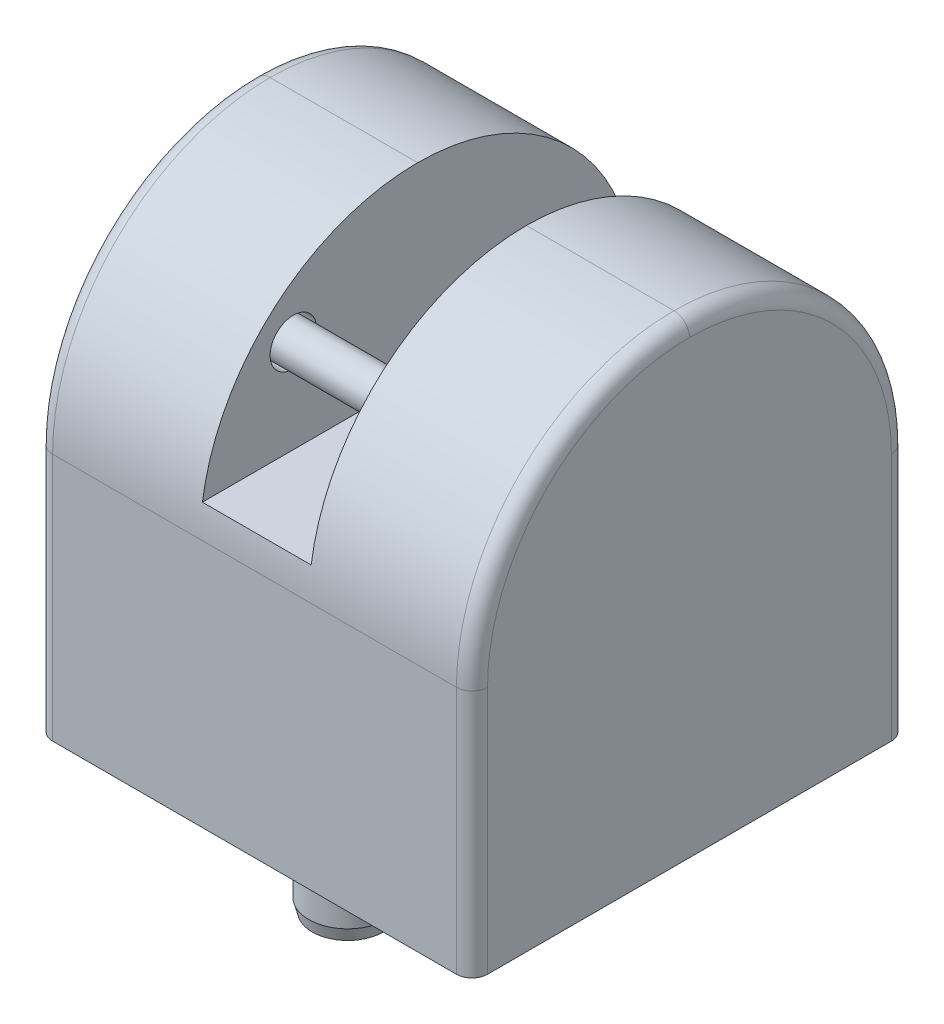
ISO-10303-21;
HEADER;
FILE_DESCRIPTION(('STEP AP214'),'2;1');
FILE_NAME('part.step','',(''),(''),'','','');
FILE_SCHEMA(('AUTOMOTIVE_DESIGN { 1 0 10303 214 1 1 1 1 }'));
ENDSEC;
DATA;
#1=APPLICATION_CONTEXT('core data for automotive mechanical design processes');
#2=APPLICATION_PROTOCOL_DEFINITION('international standard','automotive_design',2000,#1);
#3=PRODUCT_CONTEXT('',#1,'mechanical');
#4=PRODUCT('Part','Part','',(#3));
#5=PRODUCT_RELATED_PRODUCT_CATEGORY('part','',(#4));
#6=PRODUCT_DEFINITION_FORMATION('','',#4);
#7=PRODUCT_DEFINITION_CONTEXT('part definition',#1,'design');
#8=PRODUCT_DEFINITION('design','',#6,#7);
#9=PRODUCT_DEFINITION_SHAPE('','',#8);
#10=(LENGTH_UNIT() NAMED_UNIT(*) SI_UNIT(.MILLI.,.METRE.));
#11=(NAMED_UNIT(*) PLANE_ANGLE_UNIT() SI_UNIT($,.RADIAN.));
#12=(NAMED_UNIT(*) SI_UNIT($,.STERADIAN.) SOLID_ANGLE_UNIT());
#13=UNCERTAINTY_MEASURE_WITH_UNIT(LENGTH_MEASURE(1.E-05),#10,'distance_accuracy_value','');
#14=(GEOMETRIC_REPRESENTATION_CONTEXT(3) GLOBAL_UNCERTAINTY_ASSIGNED_CONTEXT((#13)) GLOBAL_UNIT_ASSIGNED_CONTEXT((#10,
#11,#12)) REPRESENTATION_CONTEXT('',''));
#15=CARTESIAN_POINT('',(0.,0.,0.));
#16=DIRECTION('',(0.,0.,1.));
#17=DIRECTION('',(1.,0.,0.));
#18=AXIS2_PLACEMENT_3D('',#15,#16,#17);
#19=CARTESIAN_POINT('',(151.285640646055,3.,-256.));
#20=DIRECTION('',(0.,1.,0.));
#21=DIRECTION('',(0.,0.,1.));
#22=AXIS2_PLACEMENT_3D('',#19,#20,#21);
#23=PLANE('',#22);
#24=CARTESIAN_POINT('',(149.,3.,-256.));
#25=DIRECTION('',(0.,-1.,0.));
#26=DIRECTION('',(0.,0.,-1.));
#27=AXIS2_PLACEMENT_3D('',#24,#25,#26);
#28=CIRCLE('',#27,2.28564064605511);
#29=CARTESIAN_POINT('',(149.,3.,-258.285640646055));
#30=VERTEX_POINT('',#29);
#31=EDGE_CURVE('E11',#30,#30,#28,.T.);
#32=ORIENTED_EDGE('',*,*,#31,.T.);
#33=EDGE_LOOP('',(#32));
#34=FACE_BOUND('',#33,.T.);
#35=ADVANCED_FACE('F43',(#34),#23,.F.);
#36=CARTESIAN_POINT('',(149.,3.8,-256.));
#37=DIRECTION('',(0.,1.,0.));
#38=DIRECTION('',(0.,0.,1.));
#39=AXIS2_PLACEMENT_3D('',#36,#37,#38);
#40=CONICAL_SURFACE('',#39,2.5,0.261799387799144);
#41=ORIENTED_EDGE('',*,*,#31,.F.);
#42=EDGE_LOOP('',(#41));
#43=FACE_BOUND('',#42,.T.);
#44=CARTESIAN_POINT('',(149.,3.8,-256.));
#45=DIRECTION('',(0.,-1.,0.));
#46=DIRECTION('',(0.,0.,-1.));
#47=AXIS2_PLACEMENT_3D('',#44,#45,#46);
#48=CIRCLE('',#47,2.5);
#49=CARTESIAN_POINT('',(149.,3.8,-258.5));
#50=VERTEX_POINT('',#49);
#51=EDGE_CURVE('E49',#50,#50,#48,.T.);
#52=ORIENTED_EDGE('',*,*,#51,.T.);
#53=EDGE_LOOP('',(#52));
#54=FACE_BOUND('',#53,.T.);
#55=ADVANCED_FACE('F75',(#43,#54),#40,.T.);
#56=CARTESIAN_POINT('',(149.,-3.34999999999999,-256.));
#57=DIRECTION('',(0.,-1.,0.));
#58=DIRECTION('',(0.,0.,-1.));
#59=AXIS2_PLACEMENT_3D('',#56,#57,#58);
#60=CYLINDRICAL_SURFACE('',#59,2.5);
#61=ORIENTED_EDGE('',*,*,#51,.F.);
#62=EDGE_LOOP('',(#61));
#63=FACE_BOUND('',#62,.T.);
#64=CARTESIAN_POINT('',(149.,18.2,-256.));
#65=DIRECTION('',(0.,-1.,0.));
#66=DIRECTION('',(0.,0.,-1.));
#67=AXIS2_PLACEMENT_3D('',#64,#65,#66);
#68=CIRCLE('',#67,2.5);
#69=CARTESIAN_POINT('',(149.,18.2,-258.5));
#70=VERTEX_POINT('',#69);
#71=EDGE_CURVE('E53',#70,#70,#68,.T.);
#72=ORIENTED_EDGE('',*,*,#71,.T.);
#73=EDGE_LOOP('',(#72));
#74=FACE_BOUND('',#73,.T.);
#75=ADVANCED_FACE('F71',(#63,#74),#60,.T.);
#76=CARTESIAN_POINT('',(149.,19.,-256.));
#77=DIRECTION('',(0.,-1.,0.));
#78=DIRECTION('',(0.,0.,-1.));
#79=AXIS2_PLACEMENT_3D('',#76,#77,#78);
#80=CONICAL_SURFACE('',#79,2.2856406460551,0.26179938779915);
#81=ORIENTED_EDGE('',*,*,#71,.F.);
#82=EDGE_LOOP('',(#81));
#83=FACE_BOUND('',#82,.T.);
#84=CARTESIAN_POINT('',(149.,19.,-256.));
#85=DIRECTION('',(0.,-1.,0.));
#86=DIRECTION('',(0.,0.,-1.));
#87=AXIS2_PLACEMENT_3D('',#84,#85,#86);
#88=CIRCLE('',#87,2.2856406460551);
#89=CARTESIAN_POINT('',(149.,19.,-258.285640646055));
#90=VERTEX_POINT('',#89);
#91=EDGE_CURVE('E57',#90,#90,#88,.T.);
#92=ORIENTED_EDGE('',*,*,#91,.T.);
#93=EDGE_LOOP('',(#92));
#94=FACE_BOUND('',#93,.T.);
#95=ADVANCED_FACE('F63',(#83,#94),#80,.T.);
#96=CARTESIAN_POINT('',(149.,19.,-256.));
#97=DIRECTION('',(0.,-1.,0.));
#98=DIRECTION('',(0.,0.,-1.));
#99=AXIS2_PLACEMENT_3D('',#96,#97,#98);
#100=PLANE('',#99);
#101=ORIENTED_EDGE('',*,*,#91,.F.);
#102=EDGE_LOOP('',(#101));
#103=FACE_BOUND('',#102,.T.);
#104=ADVANCED_FACE('F65',(#103),#100,.F.);
#105=CLOSED_SHELL('',(#35,#55,#75,#95,#104));
#106=MANIFOLD_SOLID_BREP('B2',#105);
#107=CARTESIAN_POINT('',(151.285640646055,3.,-240.));
#108=DIRECTION('',(0.,1.,0.));
#109=DIRECTION('',(0.,0.,1.));
#110=AXIS2_PLACEMENT_3D('',#107,#108,#109);
#111=PLANE('',#110);
#112=CARTESIAN_POINT('',(149.,3.,-240.));
#113=DIRECTION('',(0.,-1.,0.));
#114=DIRECTION('',(0.,0.,-1.));
#115=AXIS2_PLACEMENT_3D('',#112,#113,#114);
#116=CIRCLE('',#115,2.28564064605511);
#117=CARTESIAN_POINT('',(149.,3.,-242.285640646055));
#118=VERTEX_POINT('',#117);
#119=EDGE_CURVE('E42',#118,#118,#116,.T.);
#120=ORIENTED_EDGE('',*,*,#119,.T.);
#121=EDGE_LOOP('',(#120));
#122=FACE_BOUND('',#121,.T.);
#123=ADVANCED_FACE('F123',(#122),#111,.F.);
#124=CARTESIAN_POINT('',(149.,3.80000000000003,-240.));
#125=DIRECTION('',(0.,1.,0.));
#126=DIRECTION('',(0.,0.,1.));
#127=AXIS2_PLACEMENT_3D('',#124,#125,#126);
#128=CONICAL_SURFACE('',#127,2.5,0.261799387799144);
#129=ORIENTED_EDGE('',*,*,#119,.F.);
#130=EDGE_LOOP('',(#129));
#131=FACE_BOUND('',#130,.T.);
#132=CARTESIAN_POINT('',(149.,3.80000000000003,-240.));
#133=DIRECTION('',(0.,-1.,0.));
#134=DIRECTION('',(0.,0.,-1.));
#135=AXIS2_PLACEMENT_3D('',#132,#133,#134);
#136=CIRCLE('',#135,2.5);
#137=CARTESIAN_POINT('',(149.,3.80000000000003,-242.5));
#138=VERTEX_POINT('',#137);
#139=EDGE_CURVE('E129',#138,#138,#136,.T.);
#140=ORIENTED_EDGE('',*,*,#139,.T.);
#141=EDGE_LOOP('',(#140));
#142=FACE_BOUND('',#141,.T.);
#143=ADVANCED_FACE('F155',(#131,#142),#128,.T.);
#144=CARTESIAN_POINT('',(149.,-3.35000000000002,-240.));
#145=DIRECTION('',(0.,-1.,0.));
#146=DIRECTION('',(0.,0.,-1.));
#147=AXIS2_PLACEMENT_3D('',#144,#145,#146);
#148=CYLINDRICAL_SURFACE('',#147,2.5);
#149=ORIENTED_EDGE('',*,*,#139,.F.);
#150=EDGE_LOOP('',(#149));
#151=FACE_BOUND('',#150,.T.);
#152=CARTESIAN_POINT('',(149.,18.2,-240.));
#153=DIRECTION('',(0.,-1.,0.));
#154=DIRECTION('',(0.,0.,-1.));
#155=AXIS2_PLACEMENT_3D('',#152,#153,#154);
#156=CIRCLE('',#155,2.5);
#157=CARTESIAN_POINT('',(149.,18.2,-242.5));
#158=VERTEX_POINT('',#157);
#159=EDGE_CURVE('E133',#158,#158,#156,.T.);
#160=ORIENTED_EDGE('',*,*,#159,.T.);
#161=EDGE_LOOP('',(#160));
#162=FACE_BOUND('',#161,.T.);
#163=ADVANCED_FACE('F151',(#151,#162),#148,.T.);
#164=CARTESIAN_POINT('',(149.,19.,-240.));
#165=DIRECTION('',(0.,-1.,0.));
#166=DIRECTION('',(0.,0.,-1.));
#167=AXIS2_PLACEMENT_3D('',#164,#165,#166);
#168=CONICAL_SURFACE('',#167,2.2856406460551,0.26179938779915);
#169=ORIENTED_EDGE('',*,*,#159,.F.);
#170=EDGE_LOOP('',(#169));
#171=FACE_BOUND('',#170,.T.);
#172=CARTESIAN_POINT('',(149.,19.,-240.));
#173=DIRECTION('',(0.,-1.,0.));
#174=DIRECTION('',(0.,0.,-1.));
#175=AXIS2_PLACEMENT_3D('',#172,#173,#174);
#176=CIRCLE('',#175,2.2856406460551);
#177=CARTESIAN_POINT('',(149.,19.,-242.285640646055));
#178=VERTEX_POINT('',#177);
#179=EDGE_CURVE('E137',#178,#178,#176,.T.);
#180=ORIENTED_EDGE('',*,*,#179,.T.);
#181=EDGE_LOOP('',(#180));
#182=FACE_BOUND('',#181,.T.);
#183=ADVANCED_FACE('F143',(#171,#182),#168,.T.);
#184=CARTESIAN_POINT('',(149.,19.,-240.));
#185=DIRECTION('',(0.,-1.,0.));
#186=DIRECTION('',(0.,0.,-1.));
#187=AXIS2_PLACEMENT_3D('',#184,#185,#186);
#188=PLANE('',#187);
#189=ORIENTED_EDGE('',*,*,#179,.F.);
#190=EDGE_LOOP('',(#189));
#191=FACE_BOUND('',#190,.T.);
#192=ADVANCED_FACE('F145',(#191),#188,.F.);
#193=CLOSED_SHELL('',(#123,#143,#163,#183,#192));
#194=MANIFOLD_SOLID_BREP('B6',#193);
#195=CARTESIAN_POINT('',(163.,39.,-234.));
#196=DIRECTION('',(-1.,0.,0.));
#197=DIRECTION('',(0.,0.,1.));
#198=AXIS2_PLACEMENT_3D('',#195,#196,#197);
#199=PLANE('',#198);
#200=DIRECTION('',(0.,0.,-1.));
#201=VECTOR('',#200,1.);
#202=CARTESIAN_POINT('',(163.,9.,-234.));
#203=LINE('',#202,#201);
#204=CARTESIAN_POINT('',(163.,9.,-235.));
#205=VERTEX_POINT('',#204);
#206=CARTESIAN_POINT('',(163.,9.,-261.));
#207=VERTEX_POINT('',#206);
#208=EDGE_CURVE('E324',#205,#207,#203,.T.);
#209=ORIENTED_EDGE('',*,*,#208,.T.);
#210=DIRECTION('',(0.,-1.,0.));
#211=VECTOR('',#210,1.);
#212=CARTESIAN_POINT('',(163.,39.,-261.));
#213=LINE('',#212,#211);
#214=CARTESIAN_POINT('',(163.,25.,-261.));
#215=VERTEX_POINT('',#214);
#216=EDGE_CURVE('E217',#207,#215,#213,.F.);
#217=ORIENTED_EDGE('',*,*,#216,.T.);
#218=CARTESIAN_POINT('',(163.,25.,-248.));
#219=DIRECTION('',(-1.,0.,0.));
#220=DIRECTION('',(0.,0.,1.));
#221=AXIS2_PLACEMENT_3D('',#218,#219,#220);
#222=CIRCLE('',#221,13.);
#223=CARTESIAN_POINT('',(163.,38.,-248.));
#224=VERTEX_POINT('',#223);
#225=EDGE_CURVE('E392',#215,#224,#222,.F.);
#226=ORIENTED_EDGE('',*,*,#225,.T.);
#227=CARTESIAN_POINT('',(163.,25.,-248.));
#228=DIRECTION('',(-1.,0.,0.));
#229=DIRECTION('',(0.,0.,1.));
#230=AXIS2_PLACEMENT_3D('',#227,#228,#229);
#231=CIRCLE('',#230,13.);
#232=CARTESIAN_POINT('',(163.,25.,-235.));
#233=VERTEX_POINT('',#232);
#234=EDGE_CURVE('E223',#224,#233,#231,.F.);
#235=ORIENTED_EDGE('',*,*,#234,.T.);
#236=DIRECTION('',(0.,-1.,0.));
#237=VECTOR('',#236,1.);
#238=CARTESIAN_POINT('',(163.,39.,-235.));
#239=LINE('',#238,#237);
#240=EDGE_CURVE('E390',#233,#205,#239,.T.);
#241=ORIENTED_EDGE('',*,*,#240,.T.);
#242=EDGE_LOOP('',(#209,#217,#226,#235,#241));
#243=FACE_BOUND('',#242,.T.);
#244=ADVANCED_FACE('F200',(#243),#199,.F.);
#245=CARTESIAN_POINT('',(163.,39.,-262.));
#246=DIRECTION('',(0.,0.,1.));
#247=DIRECTION('',(1.,0.,0.));
#248=AXIS2_PLACEMENT_3D('',#245,#246,#247);
#249=PLANE('',#248);
#250=DIRECTION('',(-1.,0.,0.));
#251=VECTOR('',#250,1.);
#252=CARTESIAN_POINT('',(163.,9.,-262.));
#253=LINE('',#252,#251);
#254=CARTESIAN_POINT('',(162.,9.,-262.));
#255=VERTEX_POINT('',#254);
#256=CARTESIAN_POINT('',(136.,9.,-262.));
#257=VERTEX_POINT('',#256);
#258=EDGE_CURVE('E332',#255,#257,#253,.T.);
#259=ORIENTED_EDGE('',*,*,#258,.T.);
#260=DIRECTION('',(0.,-1.,0.));
#261=VECTOR('',#260,1.);
#262=CARTESIAN_POINT('',(136.,39.,-262.));
#263=LINE('',#262,#261);
#264=CARTESIAN_POINT('',(136.,25.,-262.));
#265=VERTEX_POINT('',#264);
#266=EDGE_CURVE('E383',#257,#265,#263,.F.);
#267=ORIENTED_EDGE('',*,*,#266,.T.);
#268=DIRECTION('',(-1.,0.,0.));
#269=VECTOR('',#268,1.);
#270=CARTESIAN_POINT('',(145.5,25.,-262.));
#271=LINE('',#270,#269);
#272=CARTESIAN_POINT('',(162.,25.,-262.));
#273=VERTEX_POINT('',#272);
#274=EDGE_CURVE('E318',#265,#273,#271,.F.);
#275=ORIENTED_EDGE('',*,*,#274,.T.);
#276=DIRECTION('',(0.,-1.,0.));
#277=VECTOR('',#276,1.);
#278=CARTESIAN_POINT('',(162.,39.,-262.));
#279=LINE('',#278,#277);
#280=EDGE_CURVE('E380',#273,#255,#279,.T.);
#281=ORIENTED_EDGE('',*,*,#280,.T.);
#282=EDGE_LOOP('',(#259,#267,#275,#281));
#283=FACE_BOUND('',#282,.T.);
#284=ADVANCED_FACE('F446',(#283),#249,.F.);
#285=CARTESIAN_POINT('',(135.,39.,-234.));
#286=DIRECTION('',(1.,0.,0.));
#287=DIRECTION('',(0.,0.,-1.));
#288=AXIS2_PLACEMENT_3D('',#285,#286,#287);
#289=PLANE('',#288);
#290=DIRECTION('',(0.,0.,1.));
#291=VECTOR('',#290,1.);
#292=CARTESIAN_POINT('',(135.,9.,-234.));
#293=LINE('',#292,#291);
#294=CARTESIAN_POINT('',(135.,9.,-261.));
#295=VERTEX_POINT('',#294);
#296=CARTESIAN_POINT('',(135.,9.,-235.));
#297=VERTEX_POINT('',#296);
#298=EDGE_CURVE('E335',#295,#297,#293,.T.);
#299=ORIENTED_EDGE('',*,*,#298,.T.);
#300=DIRECTION('',(0.,-1.,0.));
#301=VECTOR('',#300,1.);
#302=CARTESIAN_POINT('',(135.,39.,-235.));
#303=LINE('',#302,#301);
#304=CARTESIAN_POINT('',(135.,25.,-235.));
#305=VERTEX_POINT('',#304);
#306=EDGE_CURVE('E378',#297,#305,#303,.F.);
#307=ORIENTED_EDGE('',*,*,#306,.T.);
#308=CARTESIAN_POINT('',(135.,25.,-248.));
#309=DIRECTION('',(1.,0.,0.));
#310=DIRECTION('',(0.,0.,-1.));
#311=AXIS2_PLACEMENT_3D('',#308,#309,#310);
#312=CIRCLE('',#311,13.);
#313=CARTESIAN_POINT('',(135.,38.,-248.));
#314=VERTEX_POINT('',#313);
#315=EDGE_CURVE('E372',#305,#314,#312,.F.);
#316=ORIENTED_EDGE('',*,*,#315,.T.);
#317=CARTESIAN_POINT('',(135.,25.,-248.));
#318=DIRECTION('',(1.,0.,0.));
#319=DIRECTION('',(0.,0.,-1.));
#320=AXIS2_PLACEMENT_3D('',#317,#318,#319);
#321=CIRCLE('',#320,13.);
#322=CARTESIAN_POINT('',(135.,25.,-261.));
#323=VERTEX_POINT('',#322);
#324=EDGE_CURVE('E374',#314,#323,#321,.F.);
#325=ORIENTED_EDGE('',*,*,#324,.T.);
#326=DIRECTION('',(0.,-1.,0.));
#327=VECTOR('',#326,1.);
#328=CARTESIAN_POINT('',(135.,39.,-261.));
#329=LINE('',#328,#327);
#330=EDGE_CURVE('E376',#323,#295,#329,.T.);
#331=ORIENTED_EDGE('',*,*,#330,.T.);
#332=EDGE_LOOP('',(#299,#307,#316,#325,#331));
#333=FACE_BOUND('',#332,.T.);
#334=ADVANCED_FACE('F451',(#333),#289,.F.);
#335=CARTESIAN_POINT('',(163.,39.,-234.));
#336=DIRECTION('',(0.,0.,-1.));
#337=DIRECTION('',(-1.,0.,0.));
#338=AXIS2_PLACEMENT_3D('',#335,#336,#337);
#339=PLANE('',#338);
#340=DIRECTION('',(1.,0.,0.));
#341=VECTOR('',#340,1.);
#342=CARTESIAN_POINT('',(135.,25.,-234.));
#343=LINE('',#342,#341);
#344=CARTESIAN_POINT('',(162.,25.,-234.));
#345=VERTEX_POINT('',#344);
#346=CARTESIAN_POINT('',(136.,25.,-234.));
#347=VERTEX_POINT('',#346);
#348=EDGE_CURVE('E307',#345,#347,#343,.F.);
#349=ORIENTED_EDGE('',*,*,#348,.T.);
#350=DIRECTION('',(0.,-1.,0.));
#351=VECTOR('',#350,1.);
#352=CARTESIAN_POINT('',(136.,39.,-234.));
#353=LINE('',#352,#351);
#354=CARTESIAN_POINT('',(136.,9.,-234.));
#355=VERTEX_POINT('',#354);
#356=EDGE_CURVE('E361',#347,#355,#353,.T.);
#357=ORIENTED_EDGE('',*,*,#356,.T.);
#358=DIRECTION('',(1.,0.,0.));
#359=VECTOR('',#358,1.);
#360=CARTESIAN_POINT('',(163.,9.,-234.));
#361=LINE('',#360,#359);
#362=CARTESIAN_POINT('',(162.,9.,-234.));
#363=VERTEX_POINT('',#362);
#364=EDGE_CURVE('E338',#355,#363,#361,.T.);
#365=ORIENTED_EDGE('',*,*,#364,.T.);
#366=DIRECTION('',(0.,-1.,0.));
#367=VECTOR('',#366,1.);
#368=CARTESIAN_POINT('',(162.,39.,-234.));
#369=LINE('',#368,#367);
#370=EDGE_CURVE('E354',#363,#345,#369,.F.);
#371=ORIENTED_EDGE('',*,*,#370,.T.);
#372=EDGE_LOOP('',(#349,#357,#365,#371));
#373=FACE_BOUND('',#372,.T.);
#374=ADVANCED_FACE('F523',(#373),#339,.F.);
#375=CARTESIAN_POINT('',(297.999999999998,9.,-492.000000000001));
#376=DIRECTION('',(0.,1.,0.));
#377=DIRECTION('',(0.,0.,-1.));
#378=AXIS2_PLACEMENT_3D('',#375,#376,#377);
#379=PLANE('',#378);
#380=CARTESIAN_POINT('',(149.,9.,-240.));
#381=DIRECTION('',(0.,1.,0.));
#382=DIRECTION('',(0.,0.,-1.));
#383=AXIS2_PLACEMENT_3D('',#380,#381,#382);
#384=CIRCLE('',#383,2.99999999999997);
#385=CARTESIAN_POINT('',(149.,9.,-243.));
#386=VERTEX_POINT('',#385);
#387=EDGE_CURVE('E204',#386,#386,#384,.F.);
#388=ORIENTED_EDGE('',*,*,#387,.F.);
#389=EDGE_LOOP('',(#388));
#390=FACE_BOUND('',#389,.T.);
#391=CARTESIAN_POINT('',(149.,9.,-256.));
#392=DIRECTION('',(0.,1.,0.));
#393=DIRECTION('',(0.,0.,-1.));
#394=AXIS2_PLACEMENT_3D('',#391,#392,#393);
#395=CIRCLE('',#394,2.99999999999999);
#396=CARTESIAN_POINT('',(149.,9.,-259.));
#397=VERTEX_POINT('',#396);
#398=EDGE_CURVE('E412',#397,#397,#395,.F.);
#399=ORIENTED_EDGE('',*,*,#398,.F.);
#400=EDGE_LOOP('',(#399));
#401=FACE_BOUND('',#400,.T.);
#402=ORIENTED_EDGE('',*,*,#364,.F.);
#403=CARTESIAN_POINT('',(136.,9.,-235.));
#404=DIRECTION('',(0.,1.,0.));
#405=DIRECTION('',(0.,0.,-1.));
#406=AXIS2_PLACEMENT_3D('',#403,#404,#405);
#407=CIRCLE('',#406,1.);
#408=EDGE_CURVE('E370',#355,#297,#407,.F.);
#409=ORIENTED_EDGE('',*,*,#408,.T.);
#410=ORIENTED_EDGE('',*,*,#298,.F.);
#411=CARTESIAN_POINT('',(136.,9.,-261.));
#412=DIRECTION('',(0.,1.,0.));
#413=DIRECTION('',(0.,0.,-1.));
#414=AXIS2_PLACEMENT_3D('',#411,#412,#413);
#415=CIRCLE('',#414,1.);
#416=EDGE_CURVE('E368',#295,#257,#415,.F.);
#417=ORIENTED_EDGE('',*,*,#416,.T.);
#418=ORIENTED_EDGE('',*,*,#258,.F.);
#419=CARTESIAN_POINT('',(162.,9.,-261.));
#420=DIRECTION('',(0.,1.,0.));
#421=DIRECTION('',(0.,0.,-1.));
#422=AXIS2_PLACEMENT_3D('',#419,#420,#421);
#423=CIRCLE('',#422,1.);
#424=EDGE_CURVE('E366',#255,#207,#423,.F.);
#425=ORIENTED_EDGE('',*,*,#424,.T.);
#426=ORIENTED_EDGE('',*,*,#208,.F.);
#427=CARTESIAN_POINT('',(162.,9.,-235.));
#428=DIRECTION('',(0.,1.,0.));
#429=DIRECTION('',(0.,0.,-1.));
#430=AXIS2_PLACEMENT_3D('',#427,#428,#429);
#431=CIRCLE('',#430,1.);
#432=EDGE_CURVE('E364',#205,#363,#431,.F.);
#433=ORIENTED_EDGE('',*,*,#432,.T.);
#434=EDGE_LOOP('',(#402,#409,#410,#417,#418,#425,#426,#433));
#435=FACE_BOUND('',#434,.T.);
#436=ADVANCED_FACE('F502',(#390,#401,#435),#379,.F.);
#437=CARTESIAN_POINT('',(152.5,27.,-234.));
#438=DIRECTION('',(1.,0.,0.));
#439=DIRECTION('',(0.,0.,-1.));
#440=AXIS2_PLACEMENT_3D('',#437,#438,#439);
#441=PLANE('',#440);
#442=CARTESIAN_POINT('',(152.5,33.,-240.));
#443=DIRECTION('',(1.,0.,0.));
#444=DIRECTION('',(0.,0.,-1.));
#445=AXIS2_PLACEMENT_3D('',#442,#443,#444);
#446=CIRCLE('',#445,1.49999999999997);
#447=CARTESIAN_POINT('',(152.5,33.,-241.5));
#448=VERTEX_POINT('',#447);
#449=EDGE_CURVE('E322',#448,#448,#446,.F.);
#450=ORIENTED_EDGE('',*,*,#449,.F.);
#451=EDGE_LOOP('',(#450));
#452=FACE_BOUND('',#451,.T.);
#453=DIRECTION('',(0.,0.,-1.));
#454=VECTOR('',#453,1.);
#455=CARTESIAN_POINT('',(152.5,27.,-234.));
#456=LINE('',#455,#454);
#457=CARTESIAN_POINT('',(152.5,27.,-234.143593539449));
#458=VERTEX_POINT('',#457);
#459=CARTESIAN_POINT('',(152.5,27.,-261.856406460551));
#460=VERTEX_POINT('',#459);
#461=EDGE_CURVE('E301',#458,#460,#456,.T.);
#462=ORIENTED_EDGE('',*,*,#461,.F.);
#463=CARTESIAN_POINT('',(152.5,25.,-248.));
#464=DIRECTION('',(1.,0.,0.));
#465=DIRECTION('',(0.,0.,-1.));
#466=AXIS2_PLACEMENT_3D('',#463,#464,#465);
#467=CIRCLE('',#466,14.);
#468=CARTESIAN_POINT('',(152.5,39.,-248.));
#469=VERTEX_POINT('',#468);
#470=EDGE_CURVE('E310',#458,#469,#467,.F.);
#471=ORIENTED_EDGE('',*,*,#470,.T.);
#472=CARTESIAN_POINT('',(152.5,25.,-248.));
#473=DIRECTION('',(1.,0.,0.));
#474=DIRECTION('',(0.,0.,-1.));
#475=AXIS2_PLACEMENT_3D('',#472,#473,#474);
#476=CIRCLE('',#475,14.);
#477=EDGE_CURVE('E319',#469,#460,#476,.F.);
#478=ORIENTED_EDGE('',*,*,#477,.T.);
#479=EDGE_LOOP('',(#462,#471,#478));
#480=FACE_BOUND('',#479,.T.);
#481=ADVANCED_FACE('F321',(#452,#480),#441,.F.);
#482=CARTESIAN_POINT('',(145.5,27.,-234.));
#483=DIRECTION('',(1.,0.,0.));
#484=DIRECTION('',(0.,0.,-1.));
#485=AXIS2_PLACEMENT_3D('',#482,#483,#484);
#486=PLANE('',#485);
#487=CARTESIAN_POINT('',(145.5,33.,-240.));
#488=DIRECTION('',(1.,0.,0.));
#489=DIRECTION('',(0.,0.,-1.));
#490=AXIS2_PLACEMENT_3D('',#487,#488,#489);
#491=CIRCLE('',#490,1.49999999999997);
#492=CARTESIAN_POINT('',(145.5,33.,-241.5));
#493=VERTEX_POINT('',#492);
#494=EDGE_CURVE('E327',#493,#493,#491,.F.);
#495=ORIENTED_EDGE('',*,*,#494,.T.);
#496=EDGE_LOOP('',(#495));
#497=FACE_BOUND('',#496,.T.);
#498=DIRECTION('',(0.,0.,-1.));
#499=VECTOR('',#498,1.);
#500=CARTESIAN_POINT('',(145.5,27.,-234.));
#501=LINE('',#500,#499);
#502=CARTESIAN_POINT('',(145.5,27.,-234.143593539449));
#503=VERTEX_POINT('',#502);
#504=CARTESIAN_POINT('',(145.5,27.,-261.856406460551));
#505=VERTEX_POINT('',#504);
#506=EDGE_CURVE('E303',#503,#505,#501,.T.);
#507=ORIENTED_EDGE('',*,*,#506,.T.);
#508=CARTESIAN_POINT('',(145.5,25.,-248.));
#509=DIRECTION('',(1.,0.,0.));
#510=DIRECTION('',(0.,0.,-1.));
#511=AXIS2_PLACEMENT_3D('',#508,#509,#510);
#512=CIRCLE('',#511,14.);
#513=CARTESIAN_POINT('',(145.5,39.,-248.));
#514=VERTEX_POINT('',#513);
#515=EDGE_CURVE('E352',#505,#514,#512,.T.);
#516=ORIENTED_EDGE('',*,*,#515,.T.);
#517=CARTESIAN_POINT('',(145.5,25.,-248.));
#518=DIRECTION('',(1.,0.,0.));
#519=DIRECTION('',(0.,0.,-1.));
#520=AXIS2_PLACEMENT_3D('',#517,#518,#519);
#521=CIRCLE('',#520,14.);
#522=EDGE_CURVE('E350',#514,#503,#521,.T.);
#523=ORIENTED_EDGE('',*,*,#522,.T.);
#524=EDGE_LOOP('',(#507,#516,#523));
#525=FACE_BOUND('',#524,.T.);
#526=ADVANCED_FACE('F442',(#497,#525),#486,.T.);
#527=CARTESIAN_POINT('',(297.999999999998,27.,-492.000000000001));
#528=DIRECTION('',(0.,-1.,0.));
#529=DIRECTION('',(1.,0.,0.));
#530=AXIS2_PLACEMENT_3D('',#527,#528,#529);
#531=PLANE('',#530);
#532=ORIENTED_EDGE('',*,*,#461,.T.);
#533=DIRECTION('',(1.,0.,0.));
#534=VECTOR('',#533,1.);
#535=CARTESIAN_POINT('',(152.5,27.,-261.856406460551));
#536=LINE('',#535,#534);
#537=EDGE_CURVE('E306',#460,#505,#536,.F.);
#538=ORIENTED_EDGE('',*,*,#537,.T.);
#539=ORIENTED_EDGE('',*,*,#506,.F.);
#540=DIRECTION('',(-1.,0.,0.));
#541=VECTOR('',#540,1.);
#542=CARTESIAN_POINT('',(145.5,27.,-234.143593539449));
#543=LINE('',#542,#541);
#544=EDGE_CURVE('E297',#503,#458,#543,.F.);
#545=ORIENTED_EDGE('',*,*,#544,.T.);
#546=EDGE_LOOP('',(#532,#538,#539,#545));
#547=FACE_BOUND('',#546,.T.);
#548=ADVANCED_FACE('F299',(#547),#531,.F.);
#549=CARTESIAN_POINT('',(139.5,33.,-240.));
#550=DIRECTION('',(-1.,0.,0.));
#551=DIRECTION('',(0.,0.,1.));
#552=AXIS2_PLACEMENT_3D('',#549,#550,#551);
#553=PLANE('',#552);
#554=CARTESIAN_POINT('',(139.5,33.,-240.));
#555=DIRECTION('',(-1.,0.,0.));
#556=DIRECTION('',(0.,0.,1.));
#557=AXIS2_PLACEMENT_3D('',#554,#555,#556);
#558=CIRCLE('',#557,1.49999999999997);
#559=CARTESIAN_POINT('',(139.5,33.,-238.5));
#560=VERTEX_POINT('',#559);
#561=EDGE_CURVE('E343',#560,#560,#558,.T.);
#562=ORIENTED_EDGE('',*,*,#561,.F.);
#563=EDGE_LOOP('',(#562));
#564=FACE_BOUND('',#563,.T.);
#565=ADVANCED_FACE('F432',(#564),#553,.F.);
#566=CARTESIAN_POINT('',(139.5,33.,-240.));
#567=DIRECTION('',(1.,0.,0.));
#568=DIRECTION('',(0.,0.,-1.));
#569=AXIS2_PLACEMENT_3D('',#566,#567,#568);
#570=CYLINDRICAL_SURFACE('',#569,1.49999999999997);
#571=ORIENTED_EDGE('',*,*,#494,.F.);
#572=EDGE_LOOP('',(#571));
#573=FACE_BOUND('',#572,.T.);
#574=ORIENTED_EDGE('',*,*,#561,.T.);
#575=EDGE_LOOP('',(#574));
#576=FACE_BOUND('',#575,.T.);
#577=ADVANCED_FACE('F430',(#573,#576),#570,.F.);
#578=CARTESIAN_POINT('',(158.5,33.,-240.));
#579=DIRECTION('',(-1.,0.,0.));
#580=DIRECTION('',(0.,0.,1.));
#581=AXIS2_PLACEMENT_3D('',#578,#579,#580);
#582=CIRCLE('',#581,1.49999999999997);
#583=CARTESIAN_POINT('',(158.5,33.,-238.5));
#584=VERTEX_POINT('',#583);
#585=EDGE_CURVE('E359',#584,#584,#582,.T.);
#586=ORIENTED_EDGE('',*,*,#585,.F.);
#587=EDGE_LOOP('',(#586));
#588=FACE_BOUND('',#587,.T.);
#589=ORIENTED_EDGE('',*,*,#449,.T.);
#590=EDGE_LOOP('',(#589));
#591=FACE_BOUND('',#590,.T.);
#592=ADVANCED_FACE('F439',(#588,#591),#570,.F.);
#593=CARTESIAN_POINT('',(158.5,33.,-240.));
#594=DIRECTION('',(-1.,0.,0.));
#595=DIRECTION('',(0.,0.,1.));
#596=AXIS2_PLACEMENT_3D('',#593,#594,#595);
#597=PLANE('',#596);
#598=ORIENTED_EDGE('',*,*,#585,.T.);
#599=EDGE_LOOP('',(#598));
#600=FACE_BOUND('',#599,.T.);
#601=ADVANCED_FACE('F462',(#600),#597,.T.);
#602=CARTESIAN_POINT('',(298.,25.,-248.000000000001));
#603=DIRECTION('',(1.,0.,0.));
#604=DIRECTION('',(0.,0.,-1.));
#605=AXIS2_PLACEMENT_3D('',#602,#603,#604);
#606=CYLINDRICAL_SURFACE('',#605,14.);
#607=ORIENTED_EDGE('',*,*,#274,.F.);
#608=CARTESIAN_POINT('',(136.,25.,-248.));
#609=DIRECTION('',(1.,0.,0.));
#610=DIRECTION('',(0.,0.,-1.));
#611=AXIS2_PLACEMENT_3D('',#608,#609,#610);
#612=CIRCLE('',#611,14.);
#613=CARTESIAN_POINT('',(136.,39.,-248.));
#614=VERTEX_POINT('',#613);
#615=EDGE_CURVE('E387',#265,#614,#612,.T.);
#616=ORIENTED_EDGE('',*,*,#615,.T.);
#617=DIRECTION('',(-1.,0.,0.));
#618=VECTOR('',#617,1.);
#619=CARTESIAN_POINT('',(135.,39.,-248.));
#620=LINE('',#619,#618);
#621=EDGE_CURVE('E356',#514,#614,#620,.T.);
#622=ORIENTED_EDGE('',*,*,#621,.F.);
#623=ORIENTED_EDGE('',*,*,#515,.F.);
#624=ORIENTED_EDGE('',*,*,#537,.F.);
#625=ORIENTED_EDGE('',*,*,#477,.F.);
#626=DIRECTION('',(-1.,0.,0.));
#627=VECTOR('',#626,1.);
#628=CARTESIAN_POINT('',(152.5,39.,-248.));
#629=LINE('',#628,#627);
#630=CARTESIAN_POINT('',(162.,39.,-248.));
#631=VERTEX_POINT('',#630);
#632=EDGE_CURVE('E314',#631,#469,#629,.T.);
#633=ORIENTED_EDGE('',*,*,#632,.F.);
#634=CARTESIAN_POINT('',(162.,25.,-248.));
#635=DIRECTION('',(-1.,0.,0.));
#636=DIRECTION('',(0.,0.,1.));
#637=AXIS2_PLACEMENT_3D('',#634,#635,#636);
#638=CIRCLE('',#637,14.);
#639=EDGE_CURVE('E385',#631,#273,#638,.T.);
#640=ORIENTED_EDGE('',*,*,#639,.T.);
#641=EDGE_LOOP('',(#607,#616,#622,#623,#624,#625,#633,#640));
#642=FACE_BOUND('',#641,.T.);
#643=ADVANCED_FACE('F459',(#642),#606,.T.);
#644=CARTESIAN_POINT('',(298.,25.,-248.000000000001));
#645=DIRECTION('',(-1.,0.,0.));
#646=DIRECTION('',(0.,0.,1.));
#647=AXIS2_PLACEMENT_3D('',#644,#645,#646);
#648=CYLINDRICAL_SURFACE('',#647,14.);
#649=ORIENTED_EDGE('',*,*,#621,.T.);
#650=CARTESIAN_POINT('',(136.,25.,-248.));
#651=DIRECTION('',(1.,0.,0.));
#652=DIRECTION('',(0.,0.,-1.));
#653=AXIS2_PLACEMENT_3D('',#650,#651,#652);
#654=CIRCLE('',#653,14.);
#655=EDGE_CURVE('E121',#614,#347,#654,.T.);
#656=ORIENTED_EDGE('',*,*,#655,.T.);
#657=ORIENTED_EDGE('',*,*,#348,.F.);
#658=CARTESIAN_POINT('',(162.,25.,-248.));
#659=DIRECTION('',(-1.,0.,0.));
#660=DIRECTION('',(0.,0.,1.));
#661=AXIS2_PLACEMENT_3D('',#658,#659,#660);
#662=CIRCLE('',#661,14.);
#663=EDGE_CURVE('E209',#345,#631,#662,.T.);
#664=ORIENTED_EDGE('',*,*,#663,.T.);
#665=ORIENTED_EDGE('',*,*,#632,.T.);
#666=ORIENTED_EDGE('',*,*,#470,.F.);
#667=ORIENTED_EDGE('',*,*,#544,.F.);
#668=ORIENTED_EDGE('',*,*,#522,.F.);
#669=EDGE_LOOP('',(#649,#656,#657,#664,#665,#666,#667,#668));
#670=FACE_BOUND('',#669,.T.);
#671=ADVANCED_FACE('F312',(#670),#648,.T.);
#672=CARTESIAN_POINT('',(136.,39.,-261.));
#673=DIRECTION('',(0.,-1.,0.));
#674=DIRECTION('',(0.,0.,1.));
#675=AXIS2_PLACEMENT_3D('',#672,#673,#674);
#676=CYLINDRICAL_SURFACE('',#675,1.);
#677=ORIENTED_EDGE('',*,*,#416,.F.);
#678=ORIENTED_EDGE('',*,*,#330,.F.);
#679=CARTESIAN_POINT('',(136.,25.,-261.));
#680=DIRECTION('',(0.,1.,0.));
#681=DIRECTION('',(0.,0.,-1.));
#682=AXIS2_PLACEMENT_3D('',#679,#680,#681);
#683=CIRCLE('',#682,1.);
#684=EDGE_CURVE('E357',#265,#323,#683,.T.);
#685=ORIENTED_EDGE('',*,*,#684,.F.);
#686=ORIENTED_EDGE('',*,*,#266,.F.);
#687=EDGE_LOOP('',(#677,#678,#685,#686));
#688=FACE_BOUND('',#687,.T.);
#689=ADVANCED_FACE('F458',(#688),#676,.T.);
#690=CARTESIAN_POINT('',(136.,25.,-248.));
#691=DIRECTION('',(1.,0.,0.));
#692=DIRECTION('',(0.,0.,-1.));
#693=AXIS2_PLACEMENT_3D('',#690,#691,#692);
#694=TOROIDAL_SURFACE('',#693,13.,1.);
#695=ORIENTED_EDGE('',*,*,#684,.T.);
#696=ORIENTED_EDGE('',*,*,#324,.F.);
#697=CARTESIAN_POINT('',(136.,38.,-248.));
#698=DIRECTION('',(0.,0.,1.));
#699=DIRECTION('',(1.,0.,0.));
#700=AXIS2_PLACEMENT_3D('',#697,#698,#699);
#701=CIRCLE('',#700,1.);
#702=EDGE_CURVE('E399',#614,#314,#701,.T.);
#703=ORIENTED_EDGE('',*,*,#702,.F.);
#704=ORIENTED_EDGE('',*,*,#615,.F.);
#705=EDGE_LOOP('',(#695,#696,#703,#704));
#706=FACE_BOUND('',#705,.T.);
#707=ADVANCED_FACE('F471',(#706),#694,.T.);
#708=CARTESIAN_POINT('',(136.,25.,-248.));
#709=DIRECTION('',(1.,0.,0.));
#710=DIRECTION('',(0.,0.,-1.));
#711=AXIS2_PLACEMENT_3D('',#708,#709,#710);
#712=TOROIDAL_SURFACE('',#711,13.,1.);
#713=ORIENTED_EDGE('',*,*,#702,.T.);
#714=ORIENTED_EDGE('',*,*,#315,.F.);
#715=CARTESIAN_POINT('',(136.,25.,-235.));
#716=DIRECTION('',(0.,-1.,0.));
#717=DIRECTION('',(0.,0.,1.));
#718=AXIS2_PLACEMENT_3D('',#715,#716,#717);
#719=CIRCLE('',#718,1.);
#720=EDGE_CURVE('E396',#347,#305,#719,.T.);
#721=ORIENTED_EDGE('',*,*,#720,.F.);
#722=ORIENTED_EDGE('',*,*,#655,.F.);
#723=EDGE_LOOP('',(#713,#714,#721,#722));
#724=FACE_BOUND('',#723,.T.);
#725=ADVANCED_FACE('F467',(#724),#712,.T.);
#726=CARTESIAN_POINT('',(136.,39.,-235.));
#727=DIRECTION('',(0.,-1.,0.));
#728=DIRECTION('',(0.,0.,1.));
#729=AXIS2_PLACEMENT_3D('',#726,#727,#728);
#730=CYLINDRICAL_SURFACE('',#729,1.);
#731=ORIENTED_EDGE('',*,*,#720,.T.);
#732=ORIENTED_EDGE('',*,*,#306,.F.);
#733=ORIENTED_EDGE('',*,*,#408,.F.);
#734=ORIENTED_EDGE('',*,*,#356,.F.);
#735=EDGE_LOOP('',(#731,#732,#733,#734));
#736=FACE_BOUND('',#735,.T.);
#737=ADVANCED_FACE('F464',(#736),#730,.T.);
#738=CARTESIAN_POINT('',(162.,39.,-235.));
#739=DIRECTION('',(0.,-1.,0.));
#740=DIRECTION('',(0.,0.,1.));
#741=AXIS2_PLACEMENT_3D('',#738,#739,#740);
#742=CYLINDRICAL_SURFACE('',#741,1.);
#743=ORIENTED_EDGE('',*,*,#432,.F.);
#744=ORIENTED_EDGE('',*,*,#240,.F.);
#745=CARTESIAN_POINT('',(162.,25.,-235.));
#746=DIRECTION('',(0.,1.,0.));
#747=DIRECTION('',(0.,0.,-1.));
#748=AXIS2_PLACEMENT_3D('',#745,#746,#747);
#749=CIRCLE('',#748,1.);
#750=EDGE_CURVE('E400',#345,#233,#749,.T.);
#751=ORIENTED_EDGE('',*,*,#750,.F.);
#752=ORIENTED_EDGE('',*,*,#370,.F.);
#753=EDGE_LOOP('',(#743,#744,#751,#752));
#754=FACE_BOUND('',#753,.T.);
#755=ADVANCED_FACE('F202',(#754),#742,.T.);
#756=CARTESIAN_POINT('',(162.,25.,-248.));
#757=DIRECTION('',(-1.,0.,0.));
#758=DIRECTION('',(0.,0.,1.));
#759=AXIS2_PLACEMENT_3D('',#756,#757,#758);
#760=TOROIDAL_SURFACE('',#759,13.,1.);
#761=ORIENTED_EDGE('',*,*,#750,.T.);
#762=ORIENTED_EDGE('',*,*,#234,.F.);
#763=CARTESIAN_POINT('',(162.,38.,-248.));
#764=DIRECTION('',(0.,0.,-1.));
#765=DIRECTION('',(-1.,0.,0.));
#766=AXIS2_PLACEMENT_3D('',#763,#764,#765);
#767=CIRCLE('',#766,1.);
#768=EDGE_CURVE('E408',#631,#224,#767,.T.);
#769=ORIENTED_EDGE('',*,*,#768,.F.);
#770=ORIENTED_EDGE('',*,*,#663,.F.);
#771=EDGE_LOOP('',(#761,#762,#769,#770));
#772=FACE_BOUND('',#771,.T.);
#773=ADVANCED_FACE('F486',(#772),#760,.T.);
#774=CARTESIAN_POINT('',(162.,25.,-248.));
#775=DIRECTION('',(-1.,0.,0.));
#776=DIRECTION('',(0.,0.,1.));
#777=AXIS2_PLACEMENT_3D('',#774,#775,#776);
#778=TOROIDAL_SURFACE('',#777,13.,1.);
#779=ORIENTED_EDGE('',*,*,#768,.T.);
#780=ORIENTED_EDGE('',*,*,#225,.F.);
#781=CARTESIAN_POINT('',(162.,25.,-261.));
#782=DIRECTION('',(0.,-1.,0.));
#783=DIRECTION('',(0.,0.,1.));
#784=AXIS2_PLACEMENT_3D('',#781,#782,#783);
#785=CIRCLE('',#784,1.);
#786=EDGE_CURVE('E405',#273,#215,#785,.T.);
#787=ORIENTED_EDGE('',*,*,#786,.F.);
#788=ORIENTED_EDGE('',*,*,#639,.F.);
#789=EDGE_LOOP('',(#779,#780,#787,#788));
#790=FACE_BOUND('',#789,.T.);
#791=ADVANCED_FACE('F483',(#790),#778,.T.);
#792=CARTESIAN_POINT('',(162.,39.,-261.));
#793=DIRECTION('',(0.,-1.,0.));
#794=DIRECTION('',(0.,0.,1.));
#795=AXIS2_PLACEMENT_3D('',#792,#793,#794);
#796=CYLINDRICAL_SURFACE('',#795,1.);
#797=ORIENTED_EDGE('',*,*,#786,.T.);
#798=ORIENTED_EDGE('',*,*,#216,.F.);
#799=ORIENTED_EDGE('',*,*,#424,.F.);
#800=ORIENTED_EDGE('',*,*,#280,.F.);
#801=EDGE_LOOP('',(#797,#798,#799,#800));
#802=FACE_BOUND('',#801,.T.);
#803=ADVANCED_FACE('F479',(#802),#796,.T.);
#804=CARTESIAN_POINT('',(149.,19.,-256.));
#805=DIRECTION('',(0.,-1.,0.));
#806=DIRECTION('',(0.,0.,1.));
#807=AXIS2_PLACEMENT_3D('',#804,#805,#806);
#808=CYLINDRICAL_SURFACE('',#807,2.99999999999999);
#809=CARTESIAN_POINT('',(149.,19.,-256.));
#810=DIRECTION('',(0.,1.,0.));
#811=DIRECTION('',(0.,0.,-1.));
#812=AXIS2_PLACEMENT_3D('',#809,#810,#811);
#813=CIRCLE('',#812,2.99999999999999);
#814=CARTESIAN_POINT('',(149.,19.,-259.));
#815=VERTEX_POINT('',#814);
#816=EDGE_CURVE('E419',#815,#815,#813,.T.);
#817=ORIENTED_EDGE('',*,*,#816,.T.);
#818=EDGE_LOOP('',(#817));
#819=FACE_BOUND('',#818,.T.);
#820=ORIENTED_EDGE('',*,*,#398,.T.);
#821=EDGE_LOOP('',(#820));
#822=FACE_BOUND('',#821,.T.);
#823=ADVANCED_FACE('F482',(#819,#822),#808,.F.);
#824=CARTESIAN_POINT('',(149.,19.,-256.));
#825=DIRECTION('',(0.,1.,0.));
#826=DIRECTION('',(0.,0.,-1.));
#827=AXIS2_PLACEMENT_3D('',#824,#825,#826);
#828=PLANE('',#827);
#829=ORIENTED_EDGE('',*,*,#816,.F.);
#830=EDGE_LOOP('',(#829));
#831=FACE_BOUND('',#830,.T.);
#832=ADVANCED_FACE('F647',(#831),#828,.F.);
#833=CARTESIAN_POINT('',(149.,19.,-240.));
#834=DIRECTION('',(0.,-1.,0.));
#835=DIRECTION('',(0.,0.,1.));
#836=AXIS2_PLACEMENT_3D('',#833,#834,#835);
#837=CYLINDRICAL_SURFACE('',#836,2.99999999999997);
#838=CARTESIAN_POINT('',(149.,19.,-240.));
#839=DIRECTION('',(0.,1.,0.));
#840=DIRECTION('',(0.,0.,-1.));
#841=AXIS2_PLACEMENT_3D('',#838,#839,#840);
#842=CIRCLE('',#841,2.99999999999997);
#843=CARTESIAN_POINT('',(149.,19.,-243.));
#844=VERTEX_POINT('',#843);
#845=EDGE_CURVE('E414',#844,#844,#842,.T.);
#846=ORIENTED_EDGE('',*,*,#845,.T.);
#847=EDGE_LOOP('',(#846));
#848=FACE_BOUND('',#847,.T.);
#849=ORIENTED_EDGE('',*,*,#387,.T.);
#850=EDGE_LOOP('',(#849));
#851=FACE_BOUND('',#850,.T.);
#852=ADVANCED_FACE('F657',(#848,#851),#837,.F.);
#853=CARTESIAN_POINT('',(149.,19.,-240.));
#854=DIRECTION('',(0.,1.,0.));
#855=DIRECTION('',(0.,0.,-1.));
#856=AXIS2_PLACEMENT_3D('',#853,#854,#855);
#857=PLANE('',#856);
#858=ORIENTED_EDGE('',*,*,#845,.F.);
#859=EDGE_LOOP('',(#858));
#860=FACE_BOUND('',#859,.T.);
#861=ADVANCED_FACE('F667',(#860),#857,.F.);
#862=CLOSED_SHELL('',(#244,#284,#334,#374,#436,#481,#526,#548,#565,#577,#592,#601,#643,#671,
#689,#707,#725,#737,#755,#773,#791,#803,#823,#832,#852,#861));
#863=MANIFOLD_SOLID_BREP('B37',#862);
#864=CARTESIAN_POINT('',(158.5,33.,-240.));
#865=DIRECTION('',(-1.,0.,0.));
#866=DIRECTION('',(0.,0.,1.));
#867=AXIS2_PLACEMENT_3D('',#864,#865,#866);
#868=CYLINDRICAL_SURFACE('',#867,1.24999999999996);
#869=CARTESIAN_POINT('',(158.,33.,-240.));
#870=DIRECTION('',(-1.,0.,0.));
#871=DIRECTION('',(0.,0.,1.));
#872=AXIS2_PLACEMENT_3D('',#869,#870,#871);
#873=CIRCLE('',#872,1.24999999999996);
#874=CARTESIAN_POINT('',(158.,33.,-238.75));
#875=VERTEX_POINT('',#874);
#876=EDGE_CURVE('E729',#875,#875,#873,.T.);
#877=ORIENTED_EDGE('',*,*,#876,.T.);
#878=EDGE_LOOP('',(#877));
#879=FACE_BOUND('',#878,.T.);
#880=CARTESIAN_POINT('',(140.,33.,-240.));
#881=DIRECTION('',(-1.,0.,0.));
#882=DIRECTION('',(0.,0.,1.));
#883=AXIS2_PLACEMENT_3D('',#880,#881,#882);
#884=CIRCLE('',#883,1.24999999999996);
#885=CARTESIAN_POINT('',(140.,33.,-238.75));
#886=VERTEX_POINT('',#885);
#887=EDGE_CURVE('E733',#886,#886,#884,.F.);
#888=ORIENTED_EDGE('',*,*,#887,.T.);
#889=EDGE_LOOP('',(#888));
#890=FACE_BOUND('',#889,.T.);
#891=ADVANCED_FACE('F718',(#879,#890),#868,.T.);
#892=CARTESIAN_POINT('',(158.5,33.,-240.));
#893=DIRECTION('',(-1.,0.,0.));
#894=DIRECTION('',(0.,0.,1.));
#895=AXIS2_PLACEMENT_3D('',#892,#893,#894);
#896=PLANE('',#895);
#897=CARTESIAN_POINT('',(158.5,33.,-240.));
#898=DIRECTION('',(-1.,0.,0.));
#899=DIRECTION('',(0.,0.,1.));
#900=AXIS2_PLACEMENT_3D('',#897,#898,#899);
#901=CIRCLE('',#900,0.749999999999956);
#902=CARTESIAN_POINT('',(158.5,33.,-239.25));
#903=VERTEX_POINT('',#902);
#904=EDGE_CURVE('E725',#903,#903,#901,.F.);
#905=ORIENTED_EDGE('',*,*,#904,.T.);
#906=EDGE_LOOP('',(#905));
#907=FACE_BOUND('',#906,.T.);
#908=ADVANCED_FACE('F749',(#907),#896,.F.);
#909=CARTESIAN_POINT('',(139.5,33.,-240.));
#910=DIRECTION('',(-1.,0.,0.));
#911=DIRECTION('',(0.,0.,1.));
#912=AXIS2_PLACEMENT_3D('',#909,#910,#911);
#913=PLANE('',#912);
#914=CARTESIAN_POINT('',(139.5,33.,-240.));
#915=DIRECTION('',(-1.,0.,0.));
#916=DIRECTION('',(0.,0.,1.));
#917=AXIS2_PLACEMENT_3D('',#914,#915,#916);
#918=CIRCLE('',#917,0.749999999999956);
#919=CARTESIAN_POINT('',(139.5,33.,-239.25));
#920=VERTEX_POINT('',#919);
#921=EDGE_CURVE('E199',#920,#920,#918,.T.);
#922=ORIENTED_EDGE('',*,*,#921,.T.);
#923=EDGE_LOOP('',(#922));
#924=FACE_BOUND('',#923,.T.);
#925=ADVANCED_FACE('F746',(#924),#913,.T.);
#926=CARTESIAN_POINT('',(158.,33.,-240.));
#927=DIRECTION('',(-1.,0.,0.));
#928=DIRECTION('',(0.,0.,1.));
#929=AXIS2_PLACEMENT_3D('',#926,#927,#928);
#930=TOROIDAL_SURFACE('',#929,0.749999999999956,0.5);
#931=ORIENTED_EDGE('',*,*,#904,.F.);
#932=EDGE_LOOP('',(#931));
#933=FACE_BOUND('',#932,.T.);
#934=ORIENTED_EDGE('',*,*,#876,.F.);
#935=EDGE_LOOP('',(#934));
#936=FACE_BOUND('',#935,.T.);
#937=ADVANCED_FACE('F742',(#933,#936),#930,.T.);
#938=CARTESIAN_POINT('',(140.,33.,-240.));
#939=DIRECTION('',(-1.,0.,0.));
#940=DIRECTION('',(0.,0.,1.));
#941=AXIS2_PLACEMENT_3D('',#938,#939,#940);
#942=TOROIDAL_SURFACE('',#941,0.749999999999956,0.5);
#943=ORIENTED_EDGE('',*,*,#887,.F.);
#944=EDGE_LOOP('',(#943));
#945=FACE_BOUND('',#944,.T.);
#946=ORIENTED_EDGE('',*,*,#921,.F.);
#947=EDGE_LOOP('',(#946));
#948=FACE_BOUND('',#947,.T.);
#949=ADVANCED_FACE('F720',(#945,#948),#942,.T.);
#950=CLOSED_SHELL('',(#891,#908,#925,#937,#949));
#951=MANIFOLD_SOLID_BREP('B115',#950);
#952=ADVANCED_BREP_SHAPE_REPRESENTATION('',(#18,#106,#194,#863,#951),#14);
#953=SHAPE_DEFINITION_REPRESENTATION(#9,#952);
ENDSEC;
END-ISO-10303-21;
